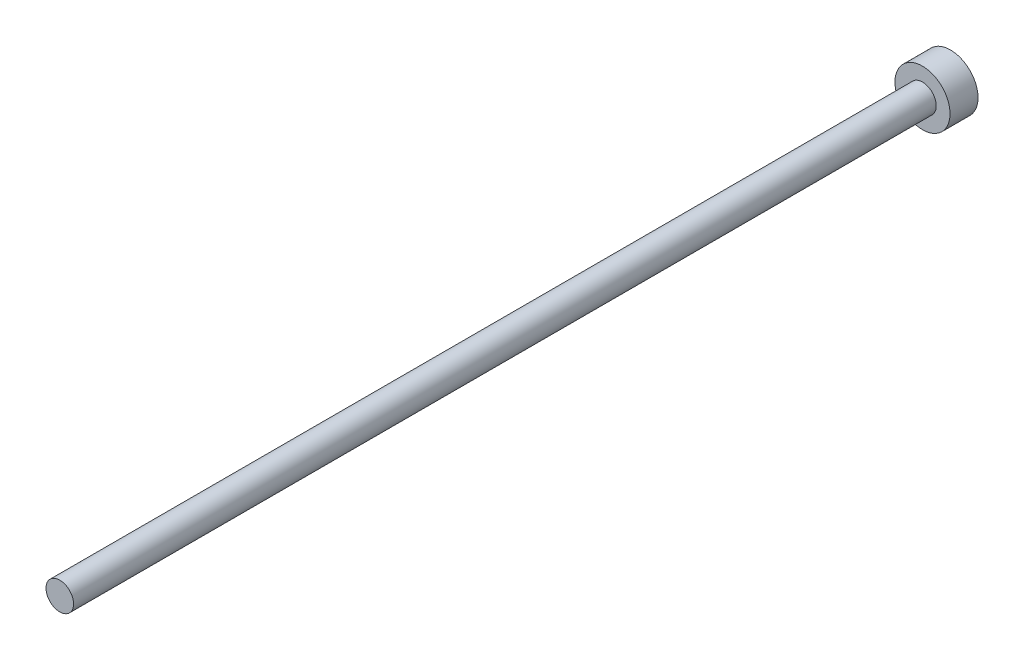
ISO-10303-21;
HEADER;
FILE_DESCRIPTION(('STEP AP214'),'2;1');
FILE_NAME('part.step','',(''),(''),'','','');
FILE_SCHEMA(('AUTOMOTIVE_DESIGN { 1 0 10303 214 1 1 1 1 }'));
ENDSEC;
DATA;
#1=APPLICATION_CONTEXT('core data for automotive mechanical design processes');
#2=APPLICATION_PROTOCOL_DEFINITION('international standard','automotive_design',2000,#1);
#3=PRODUCT_CONTEXT('',#1,'mechanical');
#4=PRODUCT('Part','Part','',(#3));
#5=PRODUCT_RELATED_PRODUCT_CATEGORY('part','',(#4));
#6=PRODUCT_DEFINITION_FORMATION('','',#4);
#7=PRODUCT_DEFINITION_CONTEXT('part definition',#1,'design');
#8=PRODUCT_DEFINITION('design','',#6,#7);
#9=PRODUCT_DEFINITION_SHAPE('','',#8);
#10=(LENGTH_UNIT() NAMED_UNIT(*) SI_UNIT(.MILLI.,.METRE.));
#11=(NAMED_UNIT(*) PLANE_ANGLE_UNIT() SI_UNIT($,.RADIAN.));
#12=(NAMED_UNIT(*) SI_UNIT($,.STERADIAN.) SOLID_ANGLE_UNIT());
#13=UNCERTAINTY_MEASURE_WITH_UNIT(LENGTH_MEASURE(1.E-05),#10,'distance_accuracy_value','');
#14=(GEOMETRIC_REPRESENTATION_CONTEXT(3) GLOBAL_UNCERTAINTY_ASSIGNED_CONTEXT((#13)) GLOBAL_UNIT_ASSIGNED_CONTEXT((#10,
#11,#12)) REPRESENTATION_CONTEXT('',''));
#15=CARTESIAN_POINT('',(0.,0.,0.));
#16=DIRECTION('',(0.,0.,1.));
#17=DIRECTION('',(1.,0.,0.));
#18=AXIS2_PLACEMENT_3D('',#15,#16,#17);
#19=CARTESIAN_POINT('',(1.63896674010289E-11,3.38618022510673E-11,93.950000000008));
#20=DIRECTION('',(0.,-2.04280296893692E-13,-1.));
#21=DIRECTION('',(-1.,2.1974089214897E-13,0.));
#22=AXIS2_PLACEMENT_3D('',#19,#20,#21);
#23=CYLINDRICAL_SURFACE('',#22,1.5);
#24=CARTESIAN_POINT('',(1.63896674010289E-11,3.38618022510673E-11,93.950000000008));
#25=DIRECTION('',(0.,2.04280296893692E-13,1.));
#26=DIRECTION('',(1.,-2.1974089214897E-13,0.));
#27=AXIS2_PLACEMENT_3D('',#24,#25,#26);
#28=CIRCLE('',#27,1.5);
#29=CARTESIAN_POINT('',(1.50000000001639,3.35321909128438E-11,93.950000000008));
#30=VERTEX_POINT('',#29);
#31=EDGE_CURVE('E10',#30,#30,#28,.T.);
#32=ORIENTED_EDGE('',*,*,#31,.F.);
#33=EDGE_LOOP('',(#32));
#34=FACE_BOUND('',#33,.T.);
#35=CARTESIAN_POINT('',(0.,-3.33066907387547E-13,0.));
#36=DIRECTION('',(0.,-2.04280296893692E-13,-1.));
#37=DIRECTION('',(-1.,2.1974089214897E-13,0.));
#38=AXIS2_PLACEMENT_3D('',#35,#36,#37);
#39=CIRCLE('',#38,1.5);
#40=CARTESIAN_POINT('',(-1.49999999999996,0.,0.));
#41=VERTEX_POINT('',#40);
#42=EDGE_CURVE('E41',#41,#41,#39,.T.);
#43=ORIENTED_EDGE('',*,*,#42,.F.);
#44=EDGE_LOOP('',(#43));
#45=FACE_BOUND('',#44,.T.);
#46=ADVANCED_FACE('F35',(#34,#45),#23,.T.);
#47=CARTESIAN_POINT('',(1.63896674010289E-11,3.38618022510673E-11,93.950000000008));
#48=DIRECTION('',(0.,2.04280296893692E-13,1.));
#49=DIRECTION('',(1.,-2.1974089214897E-13,0.));
#50=AXIS2_PLACEMENT_3D('',#47,#48,#49);
#51=PLANE('',#50);
#52=ORIENTED_EDGE('',*,*,#31,.T.);
#53=EDGE_LOOP('',(#52));
#54=FACE_BOUND('',#53,.T.);
#55=ADVANCED_FACE('F59',(#54),#51,.T.);
#56=CARTESIAN_POINT('',(0.,-3.33066907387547E-13,0.));
#57=DIRECTION('',(0.,-2.04280296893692E-13,-1.));
#58=DIRECTION('',(-1.,2.1974089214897E-13,0.));
#59=AXIS2_PLACEMENT_3D('',#56,#57,#58);
#60=PLANE('',#59);
#61=CARTESIAN_POINT('',(0.,-3.33066907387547E-13,0.));
#62=DIRECTION('',(0.,-2.04280296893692E-13,-1.));
#63=DIRECTION('',(-1.,2.1974089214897E-13,0.));
#64=AXIS2_PLACEMENT_3D('',#61,#62,#63);
#65=CIRCLE('',#64,3.);
#66=CARTESIAN_POINT('',(-2.99999999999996,3.26155769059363E-13,0.));
#67=VERTEX_POINT('',#66);
#68=EDGE_CURVE('E49',#67,#67,#65,.T.);
#69=ORIENTED_EDGE('',*,*,#68,.F.);
#70=EDGE_LOOP('',(#69));
#71=FACE_BOUND('',#70,.T.);
#72=ORIENTED_EDGE('',*,*,#42,.T.);
#73=EDGE_LOOP('',(#72));
#74=FACE_BOUND('',#73,.T.);
#75=ADVANCED_FACE('F57',(#71,#74),#60,.F.);
#76=CARTESIAN_POINT('',(-3.55132590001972E-11,-1.66533453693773E-13,-3.04999999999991));
#77=DIRECTION('',(0.,2.04280296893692E-13,1.));
#78=DIRECTION('',(1.,-2.1974089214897E-13,0.));
#79=AXIS2_PLACEMENT_3D('',#76,#77,#78);
#80=CYLINDRICAL_SURFACE('',#79,3.);
#81=CARTESIAN_POINT('',(-3.55132590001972E-11,-1.66533453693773E-13,-3.04999999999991));
#82=DIRECTION('',(0.,-2.04280296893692E-13,-1.));
#83=DIRECTION('',(-1.,2.1974089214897E-13,0.));
#84=AXIS2_PLACEMENT_3D('',#81,#82,#83);
#85=CIRCLE('',#84,3.);
#86=CARTESIAN_POINT('',(-3.00000000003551,4.92689222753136E-13,-3.04999999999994));
#87=VERTEX_POINT('',#86);
#88=EDGE_CURVE('E45',#87,#87,#85,.T.);
#89=ORIENTED_EDGE('',*,*,#88,.F.);
#90=EDGE_LOOP('',(#89));
#91=FACE_BOUND('',#90,.T.);
#92=ORIENTED_EDGE('',*,*,#68,.T.);
#93=EDGE_LOOP('',(#92));
#94=FACE_BOUND('',#93,.T.);
#95=ADVANCED_FACE('F55',(#91,#94),#80,.T.);
#96=CARTESIAN_POINT('',(-3.55132590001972E-11,-1.66533453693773E-13,-3.04999999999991));
#97=DIRECTION('',(0.,-2.04280296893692E-13,-1.));
#98=DIRECTION('',(-1.,2.1974089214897E-13,0.));
#99=AXIS2_PLACEMENT_3D('',#96,#97,#98);
#100=PLANE('',#99);
#101=ORIENTED_EDGE('',*,*,#88,.T.);
#102=EDGE_LOOP('',(#101));
#103=FACE_BOUND('',#102,.T.);
#104=ADVANCED_FACE('F65',(#103),#100,.T.);
#105=CLOSED_SHELL('',(#46,#55,#75,#95,#104));
#106=MANIFOLD_SOLID_BREP('B2',#105);
#107=ADVANCED_BREP_SHAPE_REPRESENTATION('',(#18,#106),#14);
#108=SHAPE_DEFINITION_REPRESENTATION(#9,#107);
ENDSEC;
END-ISO-10303-21;
